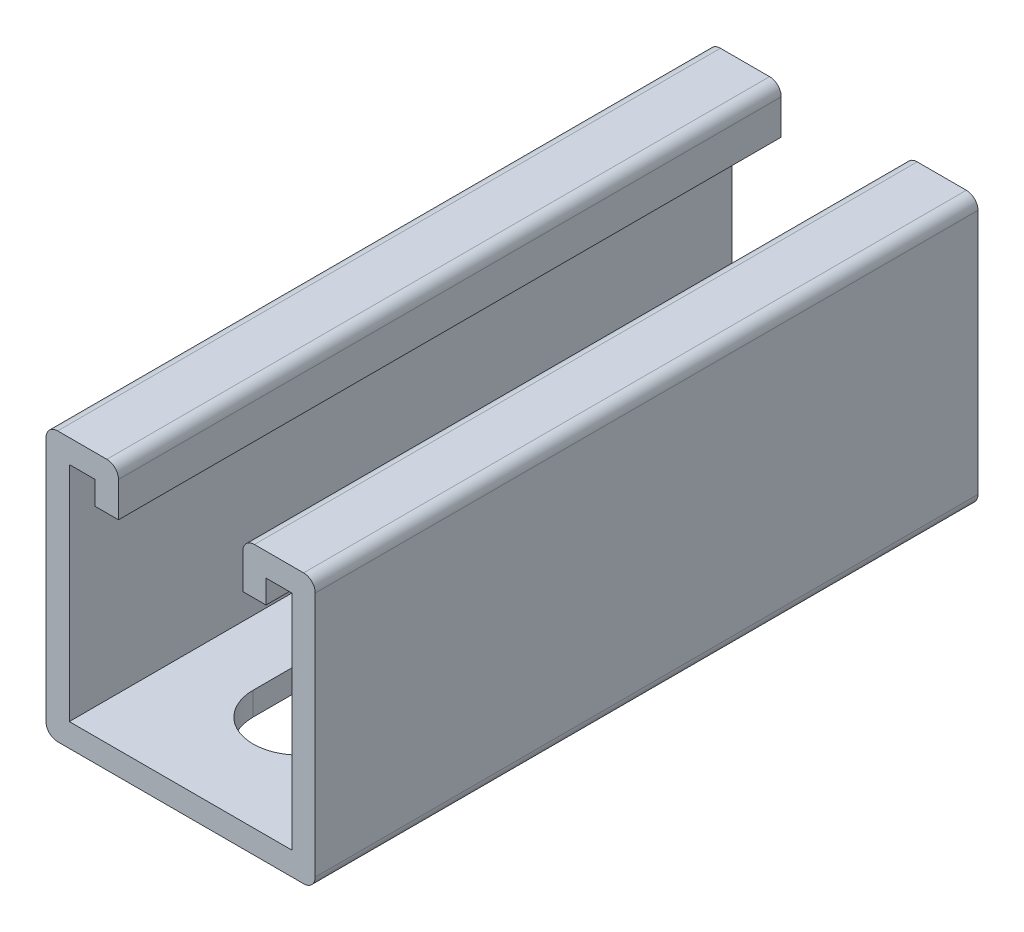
ISO-10303-21;
HEADER;
FILE_DESCRIPTION(('STEP AP214'),'2;1');
FILE_NAME('part.step','',(''),(''),'','','');
FILE_SCHEMA(('AUTOMOTIVE_DESIGN { 1 0 10303 214 1 1 1 1 }'));
ENDSEC;
DATA;
#1=APPLICATION_CONTEXT('core data for automotive mechanical design processes');
#2=APPLICATION_PROTOCOL_DEFINITION('international standard','automotive_design',2000,#1);
#3=PRODUCT_CONTEXT('',#1,'mechanical');
#4=PRODUCT('Part','Part','',(#3));
#5=PRODUCT_RELATED_PRODUCT_CATEGORY('part','',(#4));
#6=PRODUCT_DEFINITION_FORMATION('','',#4);
#7=PRODUCT_DEFINITION_CONTEXT('part definition',#1,'design');
#8=PRODUCT_DEFINITION('design','',#6,#7);
#9=PRODUCT_DEFINITION_SHAPE('','',#8);
#10=(LENGTH_UNIT() NAMED_UNIT(*) SI_UNIT(.MILLI.,.METRE.));
#11=(NAMED_UNIT(*) PLANE_ANGLE_UNIT() SI_UNIT($,.RADIAN.));
#12=(NAMED_UNIT(*) SI_UNIT($,.STERADIAN.) SOLID_ANGLE_UNIT());
#13=UNCERTAINTY_MEASURE_WITH_UNIT(LENGTH_MEASURE(1.E-05),#10,'distance_accuracy_value','');
#14=(GEOMETRIC_REPRESENTATION_CONTEXT(3) GLOBAL_UNCERTAINTY_ASSIGNED_CONTEXT((#13)) GLOBAL_UNIT_ASSIGNED_CONTEXT((#10,
#11,#12)) REPRESENTATION_CONTEXT('',''));
#15=CARTESIAN_POINT('',(0.,0.,0.));
#16=DIRECTION('',(0.,0.,1.));
#17=DIRECTION('',(1.,0.,0.));
#18=AXIS2_PLACEMENT_3D('',#15,#16,#17);
#19=CARTESIAN_POINT('',(9.525,13.49375,101.6));
#20=DIRECTION('',(0.,1.,0.));
#21=DIRECTION('',(0.,0.,1.));
#22=AXIS2_PLACEMENT_3D('',#19,#20,#21);
#23=PLANE('',#22);
#24=DIRECTION('',(1.,0.,0.));
#25=VECTOR('',#24,1.);
#26=CARTESIAN_POINT('',(9.525,13.49375,0.));
#27=LINE('',#26,#25);
#28=CARTESIAN_POINT('',(9.525,13.49375,0.));
#29=VERTEX_POINT('',#28);
#30=CARTESIAN_POINT('',(13.096875,13.49375,0.));
#31=VERTEX_POINT('',#30);
#32=EDGE_CURVE('E295',#29,#31,#27,.T.);
#33=ORIENTED_EDGE('',*,*,#32,.T.);
#34=DIRECTION('',(0.,0.,-1.));
#35=VECTOR('',#34,1.);
#36=CARTESIAN_POINT('',(13.096875,13.49375,101.6));
#37=LINE('',#36,#35);
#38=CARTESIAN_POINT('',(13.096875,13.49375,101.6));
#39=VERTEX_POINT('',#38);
#40=EDGE_CURVE('E11',#39,#31,#37,.T.);
#41=ORIENTED_EDGE('',*,*,#40,.F.);
#42=DIRECTION('',(1.,0.,0.));
#43=VECTOR('',#42,1.);
#44=CARTESIAN_POINT('',(9.525,13.49375,101.6));
#45=LINE('',#44,#43);
#46=CARTESIAN_POINT('',(9.525,13.49375,101.6));
#47=VERTEX_POINT('',#46);
#48=EDGE_CURVE('E296',#47,#39,#45,.T.);
#49=ORIENTED_EDGE('',*,*,#48,.F.);
#50=DIRECTION('',(0.,0.,-1.));
#51=VECTOR('',#50,1.);
#52=CARTESIAN_POINT('',(9.525,13.49375,101.6));
#53=LINE('',#52,#51);
#54=EDGE_CURVE('E342',#47,#29,#53,.T.);
#55=ORIENTED_EDGE('',*,*,#54,.T.);
#56=EDGE_LOOP('',(#33,#41,#49,#55));
#57=FACE_BOUND('',#56,.T.);
#58=ADVANCED_FACE('F32',(#57),#23,.F.);
#59=CARTESIAN_POINT('',(13.096875,17.065625,101.6));
#60=DIRECTION('',(-1.,0.,0.));
#61=DIRECTION('',(0.,0.,1.));
#62=AXIS2_PLACEMENT_3D('',#59,#60,#61);
#63=PLANE('',#62);
#64=DIRECTION('',(0.,1.,0.));
#65=VECTOR('',#64,1.);
#66=CARTESIAN_POINT('',(13.096875,17.065625,0.));
#67=LINE('',#66,#65);
#68=CARTESIAN_POINT('',(13.096875,17.065625,0.));
#69=VERTEX_POINT('',#68);
#70=EDGE_CURVE('E345',#31,#69,#67,.T.);
#71=ORIENTED_EDGE('',*,*,#70,.T.);
#72=DIRECTION('',(0.,0.,-1.));
#73=VECTOR('',#72,1.);
#74=CARTESIAN_POINT('',(13.096875,17.065625,101.6));
#75=LINE('',#74,#73);
#76=CARTESIAN_POINT('',(13.096875,17.065625,101.6));
#77=VERTEX_POINT('',#76);
#78=EDGE_CURVE('E39',#77,#69,#75,.T.);
#79=ORIENTED_EDGE('',*,*,#78,.F.);
#80=DIRECTION('',(0.,1.,0.));
#81=VECTOR('',#80,1.);
#82=CARTESIAN_POINT('',(13.096875,17.065625,101.6));
#83=LINE('',#82,#81);
#84=EDGE_CURVE('E299',#39,#77,#83,.T.);
#85=ORIENTED_EDGE('',*,*,#84,.F.);
#86=ORIENTED_EDGE('',*,*,#40,.T.);
#87=EDGE_LOOP('',(#71,#79,#85,#86));
#88=FACE_BOUND('',#87,.T.);
#89=ADVANCED_FACE('F472',(#88),#63,.F.);
#90=CARTESIAN_POINT('',(17.065625,17.065625,101.6));
#91=DIRECTION('',(0.,1.,0.));
#92=DIRECTION('',(0.,0.,1.));
#93=AXIS2_PLACEMENT_3D('',#90,#91,#92);
#94=PLANE('',#93);
#95=DIRECTION('',(1.,0.,0.));
#96=VECTOR('',#95,1.);
#97=CARTESIAN_POINT('',(17.065625,17.065625,0.));
#98=LINE('',#97,#96);
#99=CARTESIAN_POINT('',(17.065625,17.065625,0.));
#100=VERTEX_POINT('',#99);
#101=EDGE_CURVE('E347',#69,#100,#98,.T.);
#102=ORIENTED_EDGE('',*,*,#101,.T.);
#103=DIRECTION('',(0.,0.,-1.));
#104=VECTOR('',#103,1.);
#105=CARTESIAN_POINT('',(17.065625,17.065625,101.6));
#106=LINE('',#105,#104);
#107=CARTESIAN_POINT('',(17.065625,17.065625,101.6));
#108=VERTEX_POINT('',#107);
#109=EDGE_CURVE('E442',#108,#100,#106,.T.);
#110=ORIENTED_EDGE('',*,*,#109,.F.);
#111=DIRECTION('',(1.,0.,0.));
#112=VECTOR('',#111,1.);
#113=CARTESIAN_POINT('',(17.065625,17.065625,101.6));
#114=LINE('',#113,#112);
#115=EDGE_CURVE('E302',#77,#108,#114,.T.);
#116=ORIENTED_EDGE('',*,*,#115,.F.);
#117=ORIENTED_EDGE('',*,*,#78,.T.);
#118=EDGE_LOOP('',(#102,#110,#116,#117));
#119=FACE_BOUND('',#118,.T.);
#120=ADVANCED_FACE('F449',(#119),#94,.F.);
#121=CARTESIAN_POINT('',(17.065625,-17.065625,101.6));
#122=DIRECTION('',(1.,0.,0.));
#123=DIRECTION('',(0.,0.,-1.));
#124=AXIS2_PLACEMENT_3D('',#121,#122,#123);
#125=PLANE('',#124);
#126=DIRECTION('',(0.,-1.,0.));
#127=VECTOR('',#126,1.);
#128=CARTESIAN_POINT('',(17.065625,-17.065625,0.));
#129=LINE('',#128,#127);
#130=CARTESIAN_POINT('',(17.065625,-17.065625,0.));
#131=VERTEX_POINT('',#130);
#132=EDGE_CURVE('E349',#100,#131,#129,.T.);
#133=ORIENTED_EDGE('',*,*,#132,.T.);
#134=DIRECTION('',(0.,0.,-1.));
#135=VECTOR('',#134,1.);
#136=CARTESIAN_POINT('',(17.065625,-17.065625,101.6));
#137=LINE('',#136,#135);
#138=CARTESIAN_POINT('',(17.065625,-17.065625,101.6));
#139=VERTEX_POINT('',#138);
#140=EDGE_CURVE('E439',#139,#131,#137,.T.);
#141=ORIENTED_EDGE('',*,*,#140,.F.);
#142=DIRECTION('',(0.,-1.,0.));
#143=VECTOR('',#142,1.);
#144=CARTESIAN_POINT('',(17.065625,-17.065625,101.6));
#145=LINE('',#144,#143);
#146=EDGE_CURVE('E304',#108,#139,#145,.T.);
#147=ORIENTED_EDGE('',*,*,#146,.F.);
#148=ORIENTED_EDGE('',*,*,#109,.T.);
#149=EDGE_LOOP('',(#133,#141,#147,#148));
#150=FACE_BOUND('',#149,.T.);
#151=ADVANCED_FACE('F460',(#150),#125,.F.);
#152=CARTESIAN_POINT('',(-17.065625,-17.065625,101.6));
#153=DIRECTION('',(0.,-1.,0.));
#154=DIRECTION('',(0.,0.,-1.));
#155=AXIS2_PLACEMENT_3D('',#152,#153,#154);
#156=PLANE('',#155);
#157=DIRECTION('',(0.,0.,1.));
#158=VECTOR('',#157,1.);
#159=CARTESIAN_POINT('',(7.14375,-17.065625,152.4));
#160=LINE('',#159,#158);
#161=CARTESIAN_POINT('',(7.14375,-17.065625,69.05625));
#162=VERTEX_POINT('',#161);
#163=CARTESIAN_POINT('',(7.14375,-17.065625,83.34375));
#164=VERTEX_POINT('',#163);
#165=EDGE_CURVE('E256',#162,#164,#160,.T.);
#166=ORIENTED_EDGE('',*,*,#165,.T.);
#167=CARTESIAN_POINT('',(0.,-17.065625,83.34375));
#168=DIRECTION('',(0.,-1.,0.));
#169=DIRECTION('',(0.,0.,-1.));
#170=AXIS2_PLACEMENT_3D('',#167,#168,#169);
#171=CIRCLE('',#170,7.14375);
#172=CARTESIAN_POINT('',(-7.14375,-17.065625,83.34375));
#173=VERTEX_POINT('',#172);
#174=EDGE_CURVE('E260',#164,#173,#171,.T.);
#175=ORIENTED_EDGE('',*,*,#174,.T.);
#176=DIRECTION('',(0.,0.,-1.));
#177=VECTOR('',#176,1.);
#178=CARTESIAN_POINT('',(-7.14375,-17.065625,152.4));
#179=LINE('',#178,#177);
#180=CARTESIAN_POINT('',(-7.14375,-17.065625,69.05625));
#181=VERTEX_POINT('',#180);
#182=EDGE_CURVE('E237',#173,#181,#179,.T.);
#183=ORIENTED_EDGE('',*,*,#182,.T.);
#184=CARTESIAN_POINT('',(0.,-17.065625,69.05625));
#185=DIRECTION('',(0.,-1.,0.));
#186=DIRECTION('',(0.,0.,-1.));
#187=AXIS2_PLACEMENT_3D('',#184,#185,#186);
#188=CIRCLE('',#187,7.14375);
#189=EDGE_CURVE('E46',#181,#162,#188,.T.);
#190=ORIENTED_EDGE('',*,*,#189,.T.);
#191=EDGE_LOOP('',(#166,#175,#183,#190));
#192=FACE_BOUND('',#191,.T.);
#193=DIRECTION('',(0.,0.,1.));
#194=VECTOR('',#193,1.);
#195=CARTESIAN_POINT('',(7.14375,-17.065625,101.6));
#196=LINE('',#195,#194);
#197=CARTESIAN_POINT('',(7.14375,-17.065625,18.25625));
#198=VERTEX_POINT('',#197);
#199=CARTESIAN_POINT('',(7.14375,-17.065625,32.54375));
#200=VERTEX_POINT('',#199);
#201=EDGE_CURVE('E289',#198,#200,#196,.T.);
#202=ORIENTED_EDGE('',*,*,#201,.T.);
#203=CARTESIAN_POINT('',(0.,-17.065625,32.54375));
#204=DIRECTION('',(0.,-1.,0.));
#205=DIRECTION('',(0.,0.,-1.));
#206=AXIS2_PLACEMENT_3D('',#203,#204,#205);
#207=CIRCLE('',#206,7.14375);
#208=CARTESIAN_POINT('',(-7.14375,-17.065625,32.54375));
#209=VERTEX_POINT('',#208);
#210=EDGE_CURVE('E292',#200,#209,#207,.T.);
#211=ORIENTED_EDGE('',*,*,#210,.T.);
#212=DIRECTION('',(0.,0.,-1.));
#213=VECTOR('',#212,1.);
#214=CARTESIAN_POINT('',(-7.14375,-17.065625,101.6));
#215=LINE('',#214,#213);
#216=CARTESIAN_POINT('',(-7.14375,-17.065625,18.25625));
#217=VERTEX_POINT('',#216);
#218=EDGE_CURVE('E277',#209,#217,#215,.T.);
#219=ORIENTED_EDGE('',*,*,#218,.T.);
#220=CARTESIAN_POINT('',(0.,-17.065625,18.25625));
#221=DIRECTION('',(0.,-1.,0.));
#222=DIRECTION('',(0.,0.,-1.));
#223=AXIS2_PLACEMENT_3D('',#220,#221,#222);
#224=CIRCLE('',#223,7.14375);
#225=EDGE_CURVE('E286',#217,#198,#224,.T.);
#226=ORIENTED_EDGE('',*,*,#225,.T.);
#227=EDGE_LOOP('',(#202,#211,#219,#226));
#228=FACE_BOUND('',#227,.T.);
#229=DIRECTION('',(-1.,0.,0.));
#230=VECTOR('',#229,1.);
#231=CARTESIAN_POINT('',(-17.065625,-17.065625,0.));
#232=LINE('',#231,#230);
#233=CARTESIAN_POINT('',(-17.065625,-17.065625,0.));
#234=VERTEX_POINT('',#233);
#235=EDGE_CURVE('E351',#131,#234,#232,.T.);
#236=ORIENTED_EDGE('',*,*,#235,.T.);
#237=DIRECTION('',(0.,0.,-1.));
#238=VECTOR('',#237,1.);
#239=CARTESIAN_POINT('',(-17.065625,-17.065625,101.6));
#240=LINE('',#239,#238);
#241=CARTESIAN_POINT('',(-17.065625,-17.065625,101.6));
#242=VERTEX_POINT('',#241);
#243=EDGE_CURVE('E436',#242,#234,#240,.T.);
#244=ORIENTED_EDGE('',*,*,#243,.F.);
#245=DIRECTION('',(-1.,0.,0.));
#246=VECTOR('',#245,1.);
#247=CARTESIAN_POINT('',(-17.065625,-17.065625,101.6));
#248=LINE('',#247,#246);
#249=EDGE_CURVE('E306',#139,#242,#248,.T.);
#250=ORIENTED_EDGE('',*,*,#249,.F.);
#251=ORIENTED_EDGE('',*,*,#140,.T.);
#252=EDGE_LOOP('',(#236,#244,#250,#251));
#253=FACE_BOUND('',#252,.T.);
#254=ADVANCED_FACE('F464',(#192,#228,#253),#156,.F.);
#255=CARTESIAN_POINT('',(-17.065625,17.065625,101.6));
#256=DIRECTION('',(-1.,0.,0.));
#257=DIRECTION('',(0.,-1.,0.));
#258=AXIS2_PLACEMENT_3D('',#255,#256,#257);
#259=PLANE('',#258);
#260=DIRECTION('',(0.,1.,0.));
#261=VECTOR('',#260,1.);
#262=CARTESIAN_POINT('',(-17.065625,17.065625,0.));
#263=LINE('',#262,#261);
#264=CARTESIAN_POINT('',(-17.065625,17.065625,0.));
#265=VERTEX_POINT('',#264);
#266=EDGE_CURVE('E353',#234,#265,#263,.T.);
#267=ORIENTED_EDGE('',*,*,#266,.T.);
#268=DIRECTION('',(0.,0.,-1.));
#269=VECTOR('',#268,1.);
#270=CARTESIAN_POINT('',(-17.065625,17.065625,101.6));
#271=LINE('',#270,#269);
#272=CARTESIAN_POINT('',(-17.065625,17.065625,101.6));
#273=VERTEX_POINT('',#272);
#274=EDGE_CURVE('E433',#273,#265,#271,.T.);
#275=ORIENTED_EDGE('',*,*,#274,.F.);
#276=DIRECTION('',(0.,1.,0.));
#277=VECTOR('',#276,1.);
#278=CARTESIAN_POINT('',(-17.065625,17.065625,101.6));
#279=LINE('',#278,#277);
#280=EDGE_CURVE('E308',#242,#273,#279,.T.);
#281=ORIENTED_EDGE('',*,*,#280,.F.);
#282=ORIENTED_EDGE('',*,*,#243,.T.);
#283=EDGE_LOOP('',(#267,#275,#281,#282));
#284=FACE_BOUND('',#283,.T.);
#285=ADVANCED_FACE('F554',(#284),#259,.F.);
#286=CARTESIAN_POINT('',(-13.096875,17.065625,101.6));
#287=DIRECTION('',(0.,1.,0.));
#288=DIRECTION('',(0.,0.,1.));
#289=AXIS2_PLACEMENT_3D('',#286,#287,#288);
#290=PLANE('',#289);
#291=DIRECTION('',(1.,0.,0.));
#292=VECTOR('',#291,1.);
#293=CARTESIAN_POINT('',(-13.096875,17.065625,0.));
#294=LINE('',#293,#292);
#295=CARTESIAN_POINT('',(-13.096875,17.065625,0.));
#296=VERTEX_POINT('',#295);
#297=EDGE_CURVE('E355',#265,#296,#294,.T.);
#298=ORIENTED_EDGE('',*,*,#297,.T.);
#299=DIRECTION('',(0.,0.,-1.));
#300=VECTOR('',#299,1.);
#301=CARTESIAN_POINT('',(-13.096875,17.065625,101.6));
#302=LINE('',#301,#300);
#303=CARTESIAN_POINT('',(-13.096875,17.065625,101.6));
#304=VERTEX_POINT('',#303);
#305=EDGE_CURVE('E430',#304,#296,#302,.T.);
#306=ORIENTED_EDGE('',*,*,#305,.F.);
#307=DIRECTION('',(1.,0.,0.));
#308=VECTOR('',#307,1.);
#309=CARTESIAN_POINT('',(-13.096875,17.065625,101.6));
#310=LINE('',#309,#308);
#311=EDGE_CURVE('E310',#273,#304,#310,.T.);
#312=ORIENTED_EDGE('',*,*,#311,.F.);
#313=ORIENTED_EDGE('',*,*,#274,.T.);
#314=EDGE_LOOP('',(#298,#306,#312,#313));
#315=FACE_BOUND('',#314,.T.);
#316=ADVANCED_FACE('F551',(#315),#290,.F.);
#317=CARTESIAN_POINT('',(-13.096875,17.065625,101.6));
#318=DIRECTION('',(1.,0.,0.));
#319=DIRECTION('',(0.,1.,0.));
#320=AXIS2_PLACEMENT_3D('',#317,#318,#319);
#321=PLANE('',#320);
#322=DIRECTION('',(0.,-1.,0.));
#323=VECTOR('',#322,1.);
#324=CARTESIAN_POINT('',(-13.096875,17.065625,0.));
#325=LINE('',#324,#323);
#326=CARTESIAN_POINT('',(-13.096875,13.49375,0.));
#327=VERTEX_POINT('',#326);
#328=EDGE_CURVE('E357',#296,#327,#325,.T.);
#329=ORIENTED_EDGE('',*,*,#328,.T.);
#330=DIRECTION('',(0.,0.,-1.));
#331=VECTOR('',#330,1.);
#332=CARTESIAN_POINT('',(-13.096875,13.49375,101.6));
#333=LINE('',#332,#331);
#334=CARTESIAN_POINT('',(-13.096875,13.49375,101.6));
#335=VERTEX_POINT('',#334);
#336=EDGE_CURVE('E427',#335,#327,#333,.T.);
#337=ORIENTED_EDGE('',*,*,#336,.F.);
#338=DIRECTION('',(0.,-1.,0.));
#339=VECTOR('',#338,1.);
#340=CARTESIAN_POINT('',(-13.096875,17.065625,101.6));
#341=LINE('',#340,#339);
#342=EDGE_CURVE('E312',#304,#335,#341,.T.);
#343=ORIENTED_EDGE('',*,*,#342,.F.);
#344=ORIENTED_EDGE('',*,*,#305,.T.);
#345=EDGE_LOOP('',(#329,#337,#343,#344));
#346=FACE_BOUND('',#345,.T.);
#347=ADVANCED_FACE('F547',(#346),#321,.F.);
#348=CARTESIAN_POINT('',(-13.096875,13.49375,101.6));
#349=DIRECTION('',(0.,1.,0.));
#350=DIRECTION('',(0.,0.,1.));
#351=AXIS2_PLACEMENT_3D('',#348,#349,#350);
#352=PLANE('',#351);
#353=DIRECTION('',(1.,0.,0.));
#354=VECTOR('',#353,1.);
#355=CARTESIAN_POINT('',(-13.096875,13.49375,0.));
#356=LINE('',#355,#354);
#357=CARTESIAN_POINT('',(-9.525,13.49375,0.));
#358=VERTEX_POINT('',#357);
#359=EDGE_CURVE('E359',#327,#358,#356,.T.);
#360=ORIENTED_EDGE('',*,*,#359,.T.);
#361=DIRECTION('',(0.,0.,-1.));
#362=VECTOR('',#361,1.);
#363=CARTESIAN_POINT('',(-9.525,13.49375,101.6));
#364=LINE('',#363,#362);
#365=CARTESIAN_POINT('',(-9.525,13.49375,101.6));
#366=VERTEX_POINT('',#365);
#367=EDGE_CURVE('E424',#366,#358,#364,.T.);
#368=ORIENTED_EDGE('',*,*,#367,.F.);
#369=DIRECTION('',(1.,0.,0.));
#370=VECTOR('',#369,1.);
#371=CARTESIAN_POINT('',(-13.096875,13.49375,101.6));
#372=LINE('',#371,#370);
#373=EDGE_CURVE('E314',#335,#366,#372,.T.);
#374=ORIENTED_EDGE('',*,*,#373,.F.);
#375=ORIENTED_EDGE('',*,*,#336,.T.);
#376=EDGE_LOOP('',(#360,#368,#374,#375));
#377=FACE_BOUND('',#376,.T.);
#378=ADVANCED_FACE('F543',(#377),#352,.F.);
#379=CARTESIAN_POINT('',(-9.525,18.8515625,101.6));
#380=DIRECTION('',(-1.,0.,0.));
#381=DIRECTION('',(0.,-1.,0.));
#382=AXIS2_PLACEMENT_3D('',#379,#380,#381);
#383=PLANE('',#382);
#384=DIRECTION('',(0.,1.,0.));
#385=VECTOR('',#384,1.);
#386=CARTESIAN_POINT('',(-9.525,18.8515625,0.));
#387=LINE('',#386,#385);
#388=CARTESIAN_POINT('',(-9.525,18.8515625,0.));
#389=VERTEX_POINT('',#388);
#390=EDGE_CURVE('E361',#358,#389,#387,.T.);
#391=ORIENTED_EDGE('',*,*,#390,.T.);
#392=DIRECTION('',(0.,0.,-1.));
#393=VECTOR('',#392,1.);
#394=CARTESIAN_POINT('',(-9.525,18.8515625,101.6));
#395=LINE('',#394,#393);
#396=CARTESIAN_POINT('',(-9.525,18.8515625,101.6));
#397=VERTEX_POINT('',#396);
#398=EDGE_CURVE('E421',#397,#389,#395,.T.);
#399=ORIENTED_EDGE('',*,*,#398,.F.);
#400=DIRECTION('',(0.,1.,0.));
#401=VECTOR('',#400,1.);
#402=CARTESIAN_POINT('',(-9.525,18.8515625,101.6));
#403=LINE('',#402,#401);
#404=EDGE_CURVE('E316',#366,#397,#403,.T.);
#405=ORIENTED_EDGE('',*,*,#404,.F.);
#406=ORIENTED_EDGE('',*,*,#367,.T.);
#407=EDGE_LOOP('',(#391,#399,#405,#406));
#408=FACE_BOUND('',#407,.T.);
#409=ADVANCED_FACE('F538',(#408),#383,.F.);
#410=CARTESIAN_POINT('',(-11.3109375,18.8515625,101.6));
#411=DIRECTION('',(0.,0.,-1.));
#412=DIRECTION('',(-1.,0.,0.));
#413=AXIS2_PLACEMENT_3D('',#410,#411,#412);
#414=CYLINDRICAL_SURFACE('',#413,1.7859375);
#415=CARTESIAN_POINT('',(-11.3109375,18.8515625,0.));
#416=DIRECTION('',(0.,0.,1.));
#417=DIRECTION('',(-1.,0.,0.));
#418=AXIS2_PLACEMENT_3D('',#415,#416,#417);
#419=CIRCLE('',#418,1.7859375);
#420=CARTESIAN_POINT('',(-11.3109375,20.6375,0.));
#421=VERTEX_POINT('',#420);
#422=EDGE_CURVE('E363',#389,#421,#419,.T.);
#423=ORIENTED_EDGE('',*,*,#422,.T.);
#424=DIRECTION('',(0.,0.,-1.));
#425=VECTOR('',#424,1.);
#426=CARTESIAN_POINT('',(-11.3109375,20.6375,101.6));
#427=LINE('',#426,#425);
#428=CARTESIAN_POINT('',(-11.3109375,20.6375,101.6));
#429=VERTEX_POINT('',#428);
#430=EDGE_CURVE('E418',#429,#421,#427,.T.);
#431=ORIENTED_EDGE('',*,*,#430,.F.);
#432=CARTESIAN_POINT('',(-11.3109375,18.8515625,101.6));
#433=DIRECTION('',(0.,0.,1.));
#434=DIRECTION('',(-1.,0.,0.));
#435=AXIS2_PLACEMENT_3D('',#432,#433,#434);
#436=CIRCLE('',#435,1.7859375);
#437=EDGE_CURVE('E318',#397,#429,#436,.T.);
#438=ORIENTED_EDGE('',*,*,#437,.F.);
#439=ORIENTED_EDGE('',*,*,#398,.T.);
#440=EDGE_LOOP('',(#423,#431,#438,#439));
#441=FACE_BOUND('',#440,.T.);
#442=ADVANCED_FACE('F532',(#441),#414,.T.);
#443=CARTESIAN_POINT('',(-11.3109375,20.6375,101.6));
#444=DIRECTION('',(0.,-1.,0.));
#445=DIRECTION('',(0.,0.,-1.));
#446=AXIS2_PLACEMENT_3D('',#443,#444,#445);
#447=PLANE('',#446);
#448=DIRECTION('',(-1.,0.,0.));
#449=VECTOR('',#448,1.);
#450=CARTESIAN_POINT('',(-11.3109375,20.6375,0.));
#451=LINE('',#450,#449);
#452=CARTESIAN_POINT('',(-18.8515625,20.6375,0.));
#453=VERTEX_POINT('',#452);
#454=EDGE_CURVE('E365',#421,#453,#451,.T.);
#455=ORIENTED_EDGE('',*,*,#454,.T.);
#456=DIRECTION('',(0.,0.,-1.));
#457=VECTOR('',#456,1.);
#458=CARTESIAN_POINT('',(-18.8515625,20.6375,101.6));
#459=LINE('',#458,#457);
#460=CARTESIAN_POINT('',(-18.8515625,20.6375,101.6));
#461=VERTEX_POINT('',#460);
#462=EDGE_CURVE('E415',#461,#453,#459,.T.);
#463=ORIENTED_EDGE('',*,*,#462,.F.);
#464=DIRECTION('',(-1.,0.,0.));
#465=VECTOR('',#464,1.);
#466=CARTESIAN_POINT('',(-11.3109375,20.6375,101.6));
#467=LINE('',#466,#465);
#468=EDGE_CURVE('E320',#429,#461,#467,.T.);
#469=ORIENTED_EDGE('',*,*,#468,.F.);
#470=ORIENTED_EDGE('',*,*,#430,.T.);
#471=EDGE_LOOP('',(#455,#463,#469,#470));
#472=FACE_BOUND('',#471,.T.);
#473=ADVANCED_FACE('F528',(#472),#447,.F.);
#474=CARTESIAN_POINT('',(-18.8515625,18.8515625,101.6));
#475=DIRECTION('',(0.,0.,-1.));
#476=DIRECTION('',(-1.,0.,0.));
#477=AXIS2_PLACEMENT_3D('',#474,#475,#476);
#478=CYLINDRICAL_SURFACE('',#477,1.7859375);
#479=CARTESIAN_POINT('',(-18.8515625,18.8515625,0.));
#480=DIRECTION('',(0.,0.,1.));
#481=DIRECTION('',(-1.,0.,0.));
#482=AXIS2_PLACEMENT_3D('',#479,#480,#481);
#483=CIRCLE('',#482,1.7859375);
#484=CARTESIAN_POINT('',(-20.6375,18.8515625,0.));
#485=VERTEX_POINT('',#484);
#486=EDGE_CURVE('E367',#453,#485,#483,.T.);
#487=ORIENTED_EDGE('',*,*,#486,.T.);
#488=DIRECTION('',(0.,0.,-1.));
#489=VECTOR('',#488,1.);
#490=CARTESIAN_POINT('',(-20.6375,18.8515625,101.6));
#491=LINE('',#490,#489);
#492=CARTESIAN_POINT('',(-20.6375,18.8515625,101.6));
#493=VERTEX_POINT('',#492);
#494=EDGE_CURVE('E412',#493,#485,#491,.T.);
#495=ORIENTED_EDGE('',*,*,#494,.F.);
#496=CARTESIAN_POINT('',(-18.8515625,18.8515625,101.6));
#497=DIRECTION('',(0.,0.,1.));
#498=DIRECTION('',(-1.,0.,0.));
#499=AXIS2_PLACEMENT_3D('',#496,#497,#498);
#500=CIRCLE('',#499,1.7859375);
#501=EDGE_CURVE('E322',#461,#493,#500,.T.);
#502=ORIENTED_EDGE('',*,*,#501,.F.);
#503=ORIENTED_EDGE('',*,*,#462,.T.);
#504=EDGE_LOOP('',(#487,#495,#502,#503));
#505=FACE_BOUND('',#504,.T.);
#506=ADVANCED_FACE('F523',(#505),#478,.T.);
#507=CARTESIAN_POINT('',(-20.6375,18.8515625,101.6));
#508=DIRECTION('',(1.,0.,0.));
#509=DIRECTION('',(0.,1.,0.));
#510=AXIS2_PLACEMENT_3D('',#507,#508,#509);
#511=PLANE('',#510);
#512=DIRECTION('',(0.,-1.,0.));
#513=VECTOR('',#512,1.);
#514=CARTESIAN_POINT('',(-20.6375,18.8515625,0.));
#515=LINE('',#514,#513);
#516=CARTESIAN_POINT('',(-20.6375,-18.8515625,0.));
#517=VERTEX_POINT('',#516);
#518=EDGE_CURVE('E369',#485,#517,#515,.T.);
#519=ORIENTED_EDGE('',*,*,#518,.T.);
#520=DIRECTION('',(0.,0.,-1.));
#521=VECTOR('',#520,1.);
#522=CARTESIAN_POINT('',(-20.6375,-18.8515625,101.6));
#523=LINE('',#522,#521);
#524=CARTESIAN_POINT('',(-20.6375,-18.8515625,101.6));
#525=VERTEX_POINT('',#524);
#526=EDGE_CURVE('E409',#525,#517,#523,.T.);
#527=ORIENTED_EDGE('',*,*,#526,.F.);
#528=DIRECTION('',(0.,-1.,0.));
#529=VECTOR('',#528,1.);
#530=CARTESIAN_POINT('',(-20.6375,18.8515625,101.6));
#531=LINE('',#530,#529);
#532=EDGE_CURVE('E324',#493,#525,#531,.T.);
#533=ORIENTED_EDGE('',*,*,#532,.F.);
#534=ORIENTED_EDGE('',*,*,#494,.T.);
#535=EDGE_LOOP('',(#519,#527,#533,#534));
#536=FACE_BOUND('',#535,.T.);
#537=ADVANCED_FACE('F517',(#536),#511,.F.);
#538=CARTESIAN_POINT('',(-18.8515625,-18.8515625,101.6));
#539=DIRECTION('',(0.,0.,-1.));
#540=DIRECTION('',(-1.,0.,0.));
#541=AXIS2_PLACEMENT_3D('',#538,#539,#540);
#542=CYLINDRICAL_SURFACE('',#541,1.7859375);
#543=CARTESIAN_POINT('',(-18.8515625,-18.8515625,0.));
#544=DIRECTION('',(0.,0.,1.));
#545=DIRECTION('',(-1.,0.,0.));
#546=AXIS2_PLACEMENT_3D('',#543,#544,#545);
#547=CIRCLE('',#546,1.7859375);
#548=CARTESIAN_POINT('',(-18.8515625,-20.6375,0.));
#549=VERTEX_POINT('',#548);
#550=EDGE_CURVE('E371',#517,#549,#547,.T.);
#551=ORIENTED_EDGE('',*,*,#550,.T.);
#552=DIRECTION('',(0.,0.,-1.));
#553=VECTOR('',#552,1.);
#554=CARTESIAN_POINT('',(-18.8515625,-20.6375,101.6));
#555=LINE('',#554,#553);
#556=CARTESIAN_POINT('',(-18.8515625,-20.6375,101.6));
#557=VERTEX_POINT('',#556);
#558=EDGE_CURVE('E406',#557,#549,#555,.T.);
#559=ORIENTED_EDGE('',*,*,#558,.F.);
#560=CARTESIAN_POINT('',(-18.8515625,-18.8515625,101.6));
#561=DIRECTION('',(0.,0.,1.));
#562=DIRECTION('',(-1.,0.,0.));
#563=AXIS2_PLACEMENT_3D('',#560,#561,#562);
#564=CIRCLE('',#563,1.7859375);
#565=EDGE_CURVE('E326',#525,#557,#564,.T.);
#566=ORIENTED_EDGE('',*,*,#565,.F.);
#567=ORIENTED_EDGE('',*,*,#526,.T.);
#568=EDGE_LOOP('',(#551,#559,#566,#567));
#569=FACE_BOUND('',#568,.T.);
#570=ADVANCED_FACE('F513',(#569),#542,.T.);
#571=CARTESIAN_POINT('',(-18.8515625,-20.6375,101.6));
#572=DIRECTION('',(0.,1.,0.));
#573=DIRECTION('',(-1.,0.,0.));
#574=AXIS2_PLACEMENT_3D('',#571,#572,#573);
#575=PLANE('',#574);
#576=DIRECTION('',(0.,0.,-1.));
#577=VECTOR('',#576,1.);
#578=CARTESIAN_POINT('',(-7.14375,-20.6375,69.05625));
#579=LINE('',#578,#577);
#580=CARTESIAN_POINT('',(-7.14375,-20.6375,83.34375));
#581=VERTEX_POINT('',#580);
#582=CARTESIAN_POINT('',(-7.14375,-20.6375,69.05625));
#583=VERTEX_POINT('',#582);
#584=EDGE_CURVE('E230',#581,#583,#579,.T.);
#585=ORIENTED_EDGE('',*,*,#584,.F.);
#586=CARTESIAN_POINT('',(0.,-20.6375,83.34375));
#587=DIRECTION('',(0.,-1.,0.));
#588=DIRECTION('',(1.,0.,0.));
#589=AXIS2_PLACEMENT_3D('',#586,#587,#588);
#590=CIRCLE('',#589,7.14375);
#591=CARTESIAN_POINT('',(7.14375,-20.6375,83.34375));
#592=VERTEX_POINT('',#591);
#593=EDGE_CURVE('E54',#592,#581,#590,.T.);
#594=ORIENTED_EDGE('',*,*,#593,.F.);
#595=DIRECTION('',(0.,0.,1.));
#596=VECTOR('',#595,1.);
#597=CARTESIAN_POINT('',(7.14375,-20.6375,83.34375));
#598=LINE('',#597,#596);
#599=CARTESIAN_POINT('',(7.14375,-20.6375,69.05625));
#600=VERTEX_POINT('',#599);
#601=EDGE_CURVE('E246',#600,#592,#598,.T.);
#602=ORIENTED_EDGE('',*,*,#601,.F.);
#603=CARTESIAN_POINT('',(0.,-20.6375,69.05625));
#604=DIRECTION('',(0.,-1.,0.));
#605=DIRECTION('',(1.,0.,0.));
#606=AXIS2_PLACEMENT_3D('',#603,#604,#605);
#607=CIRCLE('',#606,7.14375);
#608=EDGE_CURVE('E240',#583,#600,#607,.T.);
#609=ORIENTED_EDGE('',*,*,#608,.F.);
#610=EDGE_LOOP('',(#585,#594,#602,#609));
#611=FACE_BOUND('',#610,.T.);
#612=DIRECTION('',(0.,0.,-1.));
#613=VECTOR('',#612,1.);
#614=CARTESIAN_POINT('',(-7.14375,-20.6375,18.25625));
#615=LINE('',#614,#613);
#616=CARTESIAN_POINT('',(-7.14375,-20.6375,32.54375));
#617=VERTEX_POINT('',#616);
#618=CARTESIAN_POINT('',(-7.14375,-20.6375,18.25625));
#619=VERTEX_POINT('',#618);
#620=EDGE_CURVE('E265',#617,#619,#615,.T.);
#621=ORIENTED_EDGE('',*,*,#620,.F.);
#622=CARTESIAN_POINT('',(0.,-20.6375,32.54375));
#623=DIRECTION('',(0.,-1.,0.));
#624=DIRECTION('',(1.,0.,0.));
#625=AXIS2_PLACEMENT_3D('',#622,#623,#624);
#626=CIRCLE('',#625,7.14375);
#627=CARTESIAN_POINT('',(7.14375,-20.6375,32.54375));
#628=VERTEX_POINT('',#627);
#629=EDGE_CURVE('E263',#628,#617,#626,.T.);
#630=ORIENTED_EDGE('',*,*,#629,.F.);
#631=DIRECTION('',(0.,0.,1.));
#632=VECTOR('',#631,1.);
#633=CARTESIAN_POINT('',(7.14375,-20.6375,32.54375));
#634=LINE('',#633,#632);
#635=CARTESIAN_POINT('',(7.14375,-20.6375,18.25625));
#636=VERTEX_POINT('',#635);
#637=EDGE_CURVE('E271',#636,#628,#634,.T.);
#638=ORIENTED_EDGE('',*,*,#637,.F.);
#639=CARTESIAN_POINT('',(0.,-20.6375,18.25625));
#640=DIRECTION('',(0.,-1.,0.));
#641=DIRECTION('',(1.,0.,0.));
#642=AXIS2_PLACEMENT_3D('',#639,#640,#641);
#643=CIRCLE('',#642,7.14375);
#644=EDGE_CURVE('E268',#619,#636,#643,.T.);
#645=ORIENTED_EDGE('',*,*,#644,.F.);
#646=EDGE_LOOP('',(#621,#630,#638,#645));
#647=FACE_BOUND('',#646,.T.);
#648=DIRECTION('',(1.,0.,0.));
#649=VECTOR('',#648,1.);
#650=CARTESIAN_POINT('',(-18.8515625,-20.6375,0.));
#651=LINE('',#650,#649);
#652=CARTESIAN_POINT('',(18.8515625,-20.6375,0.));
#653=VERTEX_POINT('',#652);
#654=EDGE_CURVE('E373',#549,#653,#651,.T.);
#655=ORIENTED_EDGE('',*,*,#654,.T.);
#656=DIRECTION('',(0.,0.,-1.));
#657=VECTOR('',#656,1.);
#658=CARTESIAN_POINT('',(18.8515625,-20.6375,101.6));
#659=LINE('',#658,#657);
#660=CARTESIAN_POINT('',(18.8515625,-20.6375,101.6));
#661=VERTEX_POINT('',#660);
#662=EDGE_CURVE('E403',#661,#653,#659,.T.);
#663=ORIENTED_EDGE('',*,*,#662,.F.);
#664=DIRECTION('',(1.,0.,0.));
#665=VECTOR('',#664,1.);
#666=CARTESIAN_POINT('',(-18.8515625,-20.6375,101.6));
#667=LINE('',#666,#665);
#668=EDGE_CURVE('E328',#557,#661,#667,.T.);
#669=ORIENTED_EDGE('',*,*,#668,.F.);
#670=ORIENTED_EDGE('',*,*,#558,.T.);
#671=EDGE_LOOP('',(#655,#663,#669,#670));
#672=FACE_BOUND('',#671,.T.);
#673=ADVANCED_FACE('F244',(#611,#647,#672),#575,.F.);
#674=CARTESIAN_POINT('',(18.8515625,-18.8515625,101.6));
#675=DIRECTION('',(0.,0.,-1.));
#676=DIRECTION('',(-1.,0.,0.));
#677=AXIS2_PLACEMENT_3D('',#674,#675,#676);
#678=CYLINDRICAL_SURFACE('',#677,1.7859375);
#679=CARTESIAN_POINT('',(18.8515625,-18.8515625,0.));
#680=DIRECTION('',(0.,0.,1.));
#681=DIRECTION('',(-1.,0.,0.));
#682=AXIS2_PLACEMENT_3D('',#679,#680,#681);
#683=CIRCLE('',#682,1.7859375);
#684=CARTESIAN_POINT('',(20.6375,-18.8515625,0.));
#685=VERTEX_POINT('',#684);
#686=EDGE_CURVE('E375',#653,#685,#683,.T.);
#687=ORIENTED_EDGE('',*,*,#686,.T.);
#688=DIRECTION('',(0.,0.,-1.));
#689=VECTOR('',#688,1.);
#690=CARTESIAN_POINT('',(20.6375,-18.8515625,101.6));
#691=LINE('',#690,#689);
#692=CARTESIAN_POINT('',(20.6375,-18.8515625,101.6));
#693=VERTEX_POINT('',#692);
#694=EDGE_CURVE('E400',#693,#685,#691,.T.);
#695=ORIENTED_EDGE('',*,*,#694,.F.);
#696=CARTESIAN_POINT('',(18.8515625,-18.8515625,101.6));
#697=DIRECTION('',(0.,0.,1.));
#698=DIRECTION('',(-1.,0.,0.));
#699=AXIS2_PLACEMENT_3D('',#696,#697,#698);
#700=CIRCLE('',#699,1.7859375);
#701=EDGE_CURVE('E330',#661,#693,#700,.T.);
#702=ORIENTED_EDGE('',*,*,#701,.F.);
#703=ORIENTED_EDGE('',*,*,#662,.T.);
#704=EDGE_LOOP('',(#687,#695,#702,#703));
#705=FACE_BOUND('',#704,.T.);
#706=ADVANCED_FACE('F503',(#705),#678,.T.);
#707=CARTESIAN_POINT('',(20.6375,-18.8515625,101.6));
#708=DIRECTION('',(-1.,0.,0.));
#709=DIRECTION('',(0.,-1.,0.));
#710=AXIS2_PLACEMENT_3D('',#707,#708,#709);
#711=PLANE('',#710);
#712=DIRECTION('',(0.,1.,0.));
#713=VECTOR('',#712,1.);
#714=CARTESIAN_POINT('',(20.6375,-18.8515625,0.));
#715=LINE('',#714,#713);
#716=CARTESIAN_POINT('',(20.6375,18.8515625,0.));
#717=VERTEX_POINT('',#716);
#718=EDGE_CURVE('E377',#685,#717,#715,.T.);
#719=ORIENTED_EDGE('',*,*,#718,.T.);
#720=DIRECTION('',(0.,0.,-1.));
#721=VECTOR('',#720,1.);
#722=CARTESIAN_POINT('',(20.6375,18.8515625,101.6));
#723=LINE('',#722,#721);
#724=CARTESIAN_POINT('',(20.6375,18.8515625,101.6));
#725=VERTEX_POINT('',#724);
#726=EDGE_CURVE('E397',#725,#717,#723,.T.);
#727=ORIENTED_EDGE('',*,*,#726,.F.);
#728=DIRECTION('',(0.,1.,0.));
#729=VECTOR('',#728,1.);
#730=CARTESIAN_POINT('',(20.6375,-18.8515625,101.6));
#731=LINE('',#730,#729);
#732=EDGE_CURVE('E332',#693,#725,#731,.T.);
#733=ORIENTED_EDGE('',*,*,#732,.F.);
#734=ORIENTED_EDGE('',*,*,#694,.T.);
#735=EDGE_LOOP('',(#719,#727,#733,#734));
#736=FACE_BOUND('',#735,.T.);
#737=ADVANCED_FACE('F499',(#736),#711,.F.);
#738=CARTESIAN_POINT('',(18.8515625,18.8515625,101.6));
#739=DIRECTION('',(0.,0.,-1.));
#740=DIRECTION('',(-1.,0.,0.));
#741=AXIS2_PLACEMENT_3D('',#738,#739,#740);
#742=CYLINDRICAL_SURFACE('',#741,1.7859375);
#743=CARTESIAN_POINT('',(18.8515625,18.8515625,0.));
#744=DIRECTION('',(0.,0.,1.));
#745=DIRECTION('',(-1.,0.,0.));
#746=AXIS2_PLACEMENT_3D('',#743,#744,#745);
#747=CIRCLE('',#746,1.7859375);
#748=CARTESIAN_POINT('',(18.8515625,20.6375,0.));
#749=VERTEX_POINT('',#748);
#750=EDGE_CURVE('E379',#717,#749,#747,.T.);
#751=ORIENTED_EDGE('',*,*,#750,.T.);
#752=DIRECTION('',(0.,0.,-1.));
#753=VECTOR('',#752,1.);
#754=CARTESIAN_POINT('',(18.8515625,20.6375,101.6));
#755=LINE('',#754,#753);
#756=CARTESIAN_POINT('',(18.8515625,20.6375,101.6));
#757=VERTEX_POINT('',#756);
#758=EDGE_CURVE('E394',#757,#749,#755,.T.);
#759=ORIENTED_EDGE('',*,*,#758,.F.);
#760=CARTESIAN_POINT('',(18.8515625,18.8515625,101.6));
#761=DIRECTION('',(0.,0.,1.));
#762=DIRECTION('',(-1.,0.,0.));
#763=AXIS2_PLACEMENT_3D('',#760,#761,#762);
#764=CIRCLE('',#763,1.7859375);
#765=EDGE_CURVE('E334',#725,#757,#764,.T.);
#766=ORIENTED_EDGE('',*,*,#765,.F.);
#767=ORIENTED_EDGE('',*,*,#726,.T.);
#768=EDGE_LOOP('',(#751,#759,#766,#767));
#769=FACE_BOUND('',#768,.T.);
#770=ADVANCED_FACE('F494',(#769),#742,.T.);
#771=CARTESIAN_POINT('',(18.8515625,20.6375,101.6));
#772=DIRECTION('',(0.,-1.,0.));
#773=DIRECTION('',(0.,0.,-1.));
#774=AXIS2_PLACEMENT_3D('',#771,#772,#773);
#775=PLANE('',#774);
#776=DIRECTION('',(-1.,0.,0.));
#777=VECTOR('',#776,1.);
#778=CARTESIAN_POINT('',(18.8515625,20.6375,0.));
#779=LINE('',#778,#777);
#780=CARTESIAN_POINT('',(11.3109375,20.6375,0.));
#781=VERTEX_POINT('',#780);
#782=EDGE_CURVE('E381',#749,#781,#779,.T.);
#783=ORIENTED_EDGE('',*,*,#782,.T.);
#784=DIRECTION('',(0.,0.,-1.));
#785=VECTOR('',#784,1.);
#786=CARTESIAN_POINT('',(11.3109375,20.6375,101.6));
#787=LINE('',#786,#785);
#788=CARTESIAN_POINT('',(11.3109375,20.6375,101.6));
#789=VERTEX_POINT('',#788);
#790=EDGE_CURVE('E391',#789,#781,#787,.T.);
#791=ORIENTED_EDGE('',*,*,#790,.F.);
#792=DIRECTION('',(-1.,0.,0.));
#793=VECTOR('',#792,1.);
#794=CARTESIAN_POINT('',(18.8515625,20.6375,101.6));
#795=LINE('',#794,#793);
#796=EDGE_CURVE('E336',#757,#789,#795,.T.);
#797=ORIENTED_EDGE('',*,*,#796,.F.);
#798=ORIENTED_EDGE('',*,*,#758,.T.);
#799=EDGE_LOOP('',(#783,#791,#797,#798));
#800=FACE_BOUND('',#799,.T.);
#801=ADVANCED_FACE('F488',(#800),#775,.F.);
#802=CARTESIAN_POINT('',(11.3109375,18.8515625,101.6));
#803=DIRECTION('',(0.,0.,-1.));
#804=DIRECTION('',(-1.,0.,0.));
#805=AXIS2_PLACEMENT_3D('',#802,#803,#804);
#806=CYLINDRICAL_SURFACE('',#805,1.7859375);
#807=CARTESIAN_POINT('',(11.3109375,18.8515625,0.));
#808=DIRECTION('',(0.,0.,1.));
#809=DIRECTION('',(-1.,0.,0.));
#810=AXIS2_PLACEMENT_3D('',#807,#808,#809);
#811=CIRCLE('',#810,1.7859375);
#812=CARTESIAN_POINT('',(9.525,18.8515625,0.));
#813=VERTEX_POINT('',#812);
#814=EDGE_CURVE('E383',#781,#813,#811,.T.);
#815=ORIENTED_EDGE('',*,*,#814,.T.);
#816=DIRECTION('',(0.,0.,-1.));
#817=VECTOR('',#816,1.);
#818=CARTESIAN_POINT('',(9.525,18.8515625,101.6));
#819=LINE('',#818,#817);
#820=CARTESIAN_POINT('',(9.525,18.8515625,101.6));
#821=VERTEX_POINT('',#820);
#822=EDGE_CURVE('E388',#821,#813,#819,.T.);
#823=ORIENTED_EDGE('',*,*,#822,.F.);
#824=CARTESIAN_POINT('',(11.3109375,18.8515625,101.6));
#825=DIRECTION('',(0.,0.,1.));
#826=DIRECTION('',(-1.,0.,0.));
#827=AXIS2_PLACEMENT_3D('',#824,#825,#826);
#828=CIRCLE('',#827,1.7859375);
#829=EDGE_CURVE('E338',#789,#821,#828,.T.);
#830=ORIENTED_EDGE('',*,*,#829,.F.);
#831=ORIENTED_EDGE('',*,*,#790,.T.);
#832=EDGE_LOOP('',(#815,#823,#830,#831));
#833=FACE_BOUND('',#832,.T.);
#834=ADVANCED_FACE('F484',(#833),#806,.T.);
#835=CARTESIAN_POINT('',(9.525,18.8515625,101.6));
#836=DIRECTION('',(1.,0.,0.));
#837=DIRECTION('',(0.,1.,0.));
#838=AXIS2_PLACEMENT_3D('',#835,#836,#837);
#839=PLANE('',#838);
#840=DIRECTION('',(0.,-1.,0.));
#841=VECTOR('',#840,1.);
#842=CARTESIAN_POINT('',(9.525,18.8515625,0.));
#843=LINE('',#842,#841);
#844=EDGE_CURVE('E300',#813,#29,#843,.T.);
#845=ORIENTED_EDGE('',*,*,#844,.T.);
#846=ORIENTED_EDGE('',*,*,#54,.F.);
#847=DIRECTION('',(0.,-1.,0.));
#848=VECTOR('',#847,1.);
#849=CARTESIAN_POINT('',(9.525,18.8515625,101.6));
#850=LINE('',#849,#848);
#851=EDGE_CURVE('E340',#821,#47,#850,.T.);
#852=ORIENTED_EDGE('',*,*,#851,.F.);
#853=ORIENTED_EDGE('',*,*,#822,.T.);
#854=EDGE_LOOP('',(#845,#846,#852,#853));
#855=FACE_BOUND('',#854,.T.);
#856=ADVANCED_FACE('F479',(#855),#839,.F.);
#857=CARTESIAN_POINT('',(-11.3109375,18.8515625,101.6));
#858=DIRECTION('',(0.,0.,-1.));
#859=DIRECTION('',(-1.,0.,0.));
#860=AXIS2_PLACEMENT_3D('',#857,#858,#859);
#861=PLANE('',#860);
#862=ORIENTED_EDGE('',*,*,#48,.T.);
#863=ORIENTED_EDGE('',*,*,#84,.T.);
#864=ORIENTED_EDGE('',*,*,#115,.T.);
#865=ORIENTED_EDGE('',*,*,#146,.T.);
#866=ORIENTED_EDGE('',*,*,#249,.T.);
#867=ORIENTED_EDGE('',*,*,#280,.T.);
#868=ORIENTED_EDGE('',*,*,#311,.T.);
#869=ORIENTED_EDGE('',*,*,#342,.T.);
#870=ORIENTED_EDGE('',*,*,#373,.T.);
#871=ORIENTED_EDGE('',*,*,#404,.T.);
#872=ORIENTED_EDGE('',*,*,#437,.T.);
#873=ORIENTED_EDGE('',*,*,#468,.T.);
#874=ORIENTED_EDGE('',*,*,#501,.T.);
#875=ORIENTED_EDGE('',*,*,#532,.T.);
#876=ORIENTED_EDGE('',*,*,#565,.T.);
#877=ORIENTED_EDGE('',*,*,#668,.T.);
#878=ORIENTED_EDGE('',*,*,#701,.T.);
#879=ORIENTED_EDGE('',*,*,#732,.T.);
#880=ORIENTED_EDGE('',*,*,#765,.T.);
#881=ORIENTED_EDGE('',*,*,#796,.T.);
#882=ORIENTED_EDGE('',*,*,#829,.T.);
#883=ORIENTED_EDGE('',*,*,#851,.T.);
#884=EDGE_LOOP('',(#862,#863,#864,#865,#866,#867,#868,#869,#870,#871,#872,#873,#874,#875,#876,
#877,#878,#879,#880,#881,#882,#883));
#885=FACE_BOUND('',#884,.T.);
#886=ADVANCED_FACE('F468',(#885),#861,.F.);
#887=CARTESIAN_POINT('',(-11.3109375,18.8515625,0.));
#888=DIRECTION('',(0.,0.,-1.));
#889=DIRECTION('',(-1.,0.,0.));
#890=AXIS2_PLACEMENT_3D('',#887,#888,#889);
#891=PLANE('',#890);
#892=ORIENTED_EDGE('',*,*,#32,.F.);
#893=ORIENTED_EDGE('',*,*,#844,.F.);
#894=ORIENTED_EDGE('',*,*,#814,.F.);
#895=ORIENTED_EDGE('',*,*,#782,.F.);
#896=ORIENTED_EDGE('',*,*,#750,.F.);
#897=ORIENTED_EDGE('',*,*,#718,.F.);
#898=ORIENTED_EDGE('',*,*,#686,.F.);
#899=ORIENTED_EDGE('',*,*,#654,.F.);
#900=ORIENTED_EDGE('',*,*,#550,.F.);
#901=ORIENTED_EDGE('',*,*,#518,.F.);
#902=ORIENTED_EDGE('',*,*,#486,.F.);
#903=ORIENTED_EDGE('',*,*,#454,.F.);
#904=ORIENTED_EDGE('',*,*,#422,.F.);
#905=ORIENTED_EDGE('',*,*,#390,.F.);
#906=ORIENTED_EDGE('',*,*,#359,.F.);
#907=ORIENTED_EDGE('',*,*,#328,.F.);
#908=ORIENTED_EDGE('',*,*,#297,.F.);
#909=ORIENTED_EDGE('',*,*,#266,.F.);
#910=ORIENTED_EDGE('',*,*,#235,.F.);
#911=ORIENTED_EDGE('',*,*,#132,.F.);
#912=ORIENTED_EDGE('',*,*,#101,.F.);
#913=ORIENTED_EDGE('',*,*,#70,.F.);
#914=EDGE_LOOP('',(#892,#893,#894,#895,#896,#897,#898,#899,#900,#901,#902,#903,#904,#905,#906,
#907,#908,#909,#910,#911,#912,#913));
#915=FACE_BOUND('',#914,.T.);
#916=ADVANCED_FACE('F455',(#915),#891,.T.);
#917=CARTESIAN_POINT('',(0.,20.6375,32.54375));
#918=DIRECTION('',(0.,-1.,0.));
#919=DIRECTION('',(1.,0.,0.));
#920=AXIS2_PLACEMENT_3D('',#917,#918,#919);
#921=CYLINDRICAL_SURFACE('',#920,7.14375);
#922=DIRECTION('',(0.,-1.,0.));
#923=VECTOR('',#922,1.);
#924=CARTESIAN_POINT('',(7.14375,20.6375,32.54375));
#925=LINE('',#924,#923);
#926=EDGE_CURVE('E275',#200,#628,#925,.T.);
#927=ORIENTED_EDGE('',*,*,#926,.T.);
#928=ORIENTED_EDGE('',*,*,#629,.T.);
#929=DIRECTION('',(0.,-1.,0.));
#930=VECTOR('',#929,1.);
#931=CARTESIAN_POINT('',(-7.14375,20.6375,32.54375));
#932=LINE('',#931,#930);
#933=EDGE_CURVE('E274',#209,#617,#932,.T.);
#934=ORIENTED_EDGE('',*,*,#933,.F.);
#935=ORIENTED_EDGE('',*,*,#210,.F.);
#936=EDGE_LOOP('',(#927,#928,#934,#935));
#937=FACE_BOUND('',#936,.T.);
#938=ADVANCED_FACE('F645',(#937),#921,.F.);
#939=CARTESIAN_POINT('',(7.14375,20.6375,32.54375));
#940=DIRECTION('',(1.,0.,0.));
#941=DIRECTION('',(0.,1.,0.));
#942=AXIS2_PLACEMENT_3D('',#939,#940,#941);
#943=PLANE('',#942);
#944=DIRECTION('',(0.,-1.,0.));
#945=VECTOR('',#944,1.);
#946=CARTESIAN_POINT('',(7.14375,20.6375,18.25625));
#947=LINE('',#946,#945);
#948=EDGE_CURVE('E278',#198,#636,#947,.T.);
#949=ORIENTED_EDGE('',*,*,#948,.T.);
#950=ORIENTED_EDGE('',*,*,#637,.T.);
#951=ORIENTED_EDGE('',*,*,#926,.F.);
#952=ORIENTED_EDGE('',*,*,#201,.F.);
#953=EDGE_LOOP('',(#949,#950,#951,#952));
#954=FACE_BOUND('',#953,.T.);
#955=ADVANCED_FACE('F641',(#954),#943,.F.);
#956=CARTESIAN_POINT('',(0.,20.6375,18.25625));
#957=DIRECTION('',(0.,-1.,0.));
#958=DIRECTION('',(1.,0.,0.));
#959=AXIS2_PLACEMENT_3D('',#956,#957,#958);
#960=CYLINDRICAL_SURFACE('',#959,7.14375);
#961=DIRECTION('',(0.,-1.,0.));
#962=VECTOR('',#961,1.);
#963=CARTESIAN_POINT('',(-7.14375,20.6375,18.25625));
#964=LINE('',#963,#962);
#965=EDGE_CURVE('E280',#217,#619,#964,.T.);
#966=ORIENTED_EDGE('',*,*,#965,.T.);
#967=ORIENTED_EDGE('',*,*,#644,.T.);
#968=ORIENTED_EDGE('',*,*,#948,.F.);
#969=ORIENTED_EDGE('',*,*,#225,.F.);
#970=EDGE_LOOP('',(#966,#967,#968,#969));
#971=FACE_BOUND('',#970,.T.);
#972=ADVANCED_FACE('F644',(#971),#960,.F.);
#973=CARTESIAN_POINT('',(-7.14375,20.6375,18.25625));
#974=DIRECTION('',(-1.,0.,0.));
#975=DIRECTION('',(0.,-1.,0.));
#976=AXIS2_PLACEMENT_3D('',#973,#974,#975);
#977=PLANE('',#976);
#978=ORIENTED_EDGE('',*,*,#933,.T.);
#979=ORIENTED_EDGE('',*,*,#620,.T.);
#980=ORIENTED_EDGE('',*,*,#965,.F.);
#981=ORIENTED_EDGE('',*,*,#218,.F.);
#982=EDGE_LOOP('',(#978,#979,#980,#981));
#983=FACE_BOUND('',#982,.T.);
#984=ADVANCED_FACE('F589',(#983),#977,.F.);
#985=CARTESIAN_POINT('',(0.,20.6375,83.34375));
#986=DIRECTION('',(0.,-1.,0.));
#987=DIRECTION('',(1.,0.,0.));
#988=AXIS2_PLACEMENT_3D('',#985,#986,#987);
#989=CYLINDRICAL_SURFACE('',#988,7.14375);
#990=DIRECTION('',(0.,-1.,0.));
#991=VECTOR('',#990,1.);
#992=CARTESIAN_POINT('',(7.14375,20.6375,83.34375));
#993=LINE('',#992,#991);
#994=EDGE_CURVE('E254',#164,#592,#993,.T.);
#995=ORIENTED_EDGE('',*,*,#994,.T.);
#996=ORIENTED_EDGE('',*,*,#593,.T.);
#997=DIRECTION('',(0.,-1.,0.));
#998=VECTOR('',#997,1.);
#999=CARTESIAN_POINT('',(-7.14375,20.6375,83.34375));
#1000=LINE('',#999,#998);
#1001=EDGE_CURVE('E234',#173,#581,#1000,.T.);
#1002=ORIENTED_EDGE('',*,*,#1001,.F.);
#1003=ORIENTED_EDGE('',*,*,#174,.F.);
#1004=EDGE_LOOP('',(#995,#996,#1002,#1003));
#1005=FACE_BOUND('',#1004,.T.);
#1006=ADVANCED_FACE('F606',(#1005),#989,.F.);
#1007=CARTESIAN_POINT('',(7.14375,20.6375,83.34375));
#1008=DIRECTION('',(1.,0.,0.));
#1009=DIRECTION('',(0.,1.,0.));
#1010=AXIS2_PLACEMENT_3D('',#1007,#1008,#1009);
#1011=PLANE('',#1010);
#1012=DIRECTION('',(0.,-1.,0.));
#1013=VECTOR('',#1012,1.);
#1014=CARTESIAN_POINT('',(7.14375,20.6375,69.05625));
#1015=LINE('',#1014,#1013);
#1016=EDGE_CURVE('E247',#162,#600,#1015,.T.);
#1017=ORIENTED_EDGE('',*,*,#1016,.T.);
#1018=ORIENTED_EDGE('',*,*,#601,.T.);
#1019=ORIENTED_EDGE('',*,*,#994,.F.);
#1020=ORIENTED_EDGE('',*,*,#165,.F.);
#1021=EDGE_LOOP('',(#1017,#1018,#1019,#1020));
#1022=FACE_BOUND('',#1021,.T.);
#1023=ADVANCED_FACE('F611',(#1022),#1011,.F.);
#1024=CARTESIAN_POINT('',(0.,20.6375,69.05625));
#1025=DIRECTION('',(0.,-1.,0.));
#1026=DIRECTION('',(1.,0.,0.));
#1027=AXIS2_PLACEMENT_3D('',#1024,#1025,#1026);
#1028=CYLINDRICAL_SURFACE('',#1027,7.14375);
#1029=DIRECTION('',(0.,-1.,0.));
#1030=VECTOR('',#1029,1.);
#1031=CARTESIAN_POINT('',(-7.14375,20.6375,69.05625));
#1032=LINE('',#1031,#1030);
#1033=EDGE_CURVE('E232',#181,#583,#1032,.T.);
#1034=ORIENTED_EDGE('',*,*,#1033,.T.);
#1035=ORIENTED_EDGE('',*,*,#608,.T.);
#1036=ORIENTED_EDGE('',*,*,#1016,.F.);
#1037=ORIENTED_EDGE('',*,*,#189,.F.);
#1038=EDGE_LOOP('',(#1034,#1035,#1036,#1037));
#1039=FACE_BOUND('',#1038,.T.);
#1040=ADVANCED_FACE('F239',(#1039),#1028,.F.);
#1041=CARTESIAN_POINT('',(-7.14375,20.6375,69.05625));
#1042=DIRECTION('',(-1.,0.,0.));
#1043=DIRECTION('',(0.,-1.,0.));
#1044=AXIS2_PLACEMENT_3D('',#1041,#1042,#1043);
#1045=PLANE('',#1044);
#1046=ORIENTED_EDGE('',*,*,#1001,.T.);
#1047=ORIENTED_EDGE('',*,*,#584,.T.);
#1048=ORIENTED_EDGE('',*,*,#1033,.F.);
#1049=ORIENTED_EDGE('',*,*,#182,.F.);
#1050=EDGE_LOOP('',(#1046,#1047,#1048,#1049));
#1051=FACE_BOUND('',#1050,.T.);
#1052=ADVANCED_FACE('F231',(#1051),#1045,.F.);
#1053=CLOSED_SHELL('',(#58,#89,#120,#151,#254,#285,#316,#347,#378,#409,#442,#473,#506,#537,#570,
#673,#706,#737,#770,#801,#834,#856,#886,#916,#938,#955,#972,#984,#1006,#1023,#1040,#1052));
#1054=MANIFOLD_SOLID_BREP('B2',#1053);
#1055=ADVANCED_BREP_SHAPE_REPRESENTATION('',(#18,#1054),#14);
#1056=SHAPE_DEFINITION_REPRESENTATION(#9,#1055);
ENDSEC;
END-ISO-10303-21;
